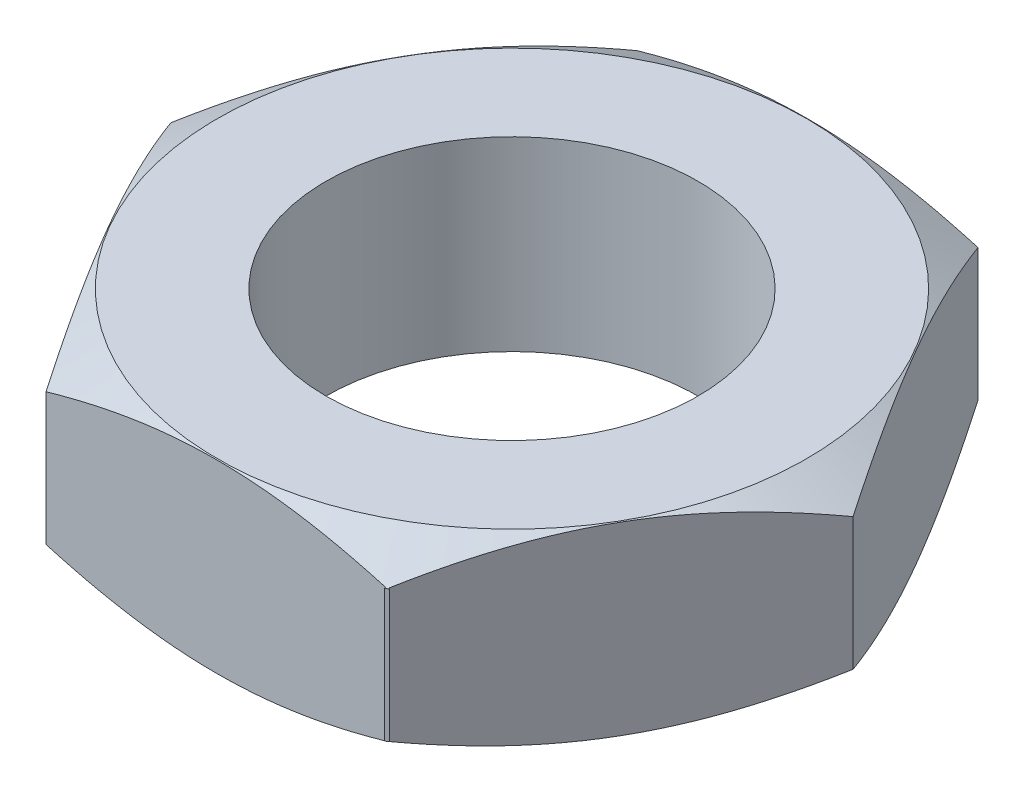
ISO-10303-21;
HEADER;
FILE_DESCRIPTION(('STEP AP214'),'2;1');
FILE_NAME('part.step','',(''),(''),'','','');
FILE_SCHEMA(('AUTOMOTIVE_DESIGN { 1 0 10303 214 1 1 1 1 }'));
ENDSEC;
DATA;
#1=APPLICATION_CONTEXT('core data for automotive mechanical design processes');
#2=APPLICATION_PROTOCOL_DEFINITION('international standard','automotive_design',2000,#1);
#3=PRODUCT_CONTEXT('',#1,'mechanical');
#4=PRODUCT('Part','Part','',(#3));
#5=PRODUCT_RELATED_PRODUCT_CATEGORY('part','',(#4));
#6=PRODUCT_DEFINITION_FORMATION('','',#4);
#7=PRODUCT_DEFINITION_CONTEXT('part definition',#1,'design');
#8=PRODUCT_DEFINITION('design','',#6,#7);
#9=PRODUCT_DEFINITION_SHAPE('','',#8);
#10=(LENGTH_UNIT() NAMED_UNIT(*) SI_UNIT(.MILLI.,.METRE.));
#11=(NAMED_UNIT(*) PLANE_ANGLE_UNIT() SI_UNIT($,.RADIAN.));
#12=(NAMED_UNIT(*) SI_UNIT($,.STERADIAN.) SOLID_ANGLE_UNIT());
#13=UNCERTAINTY_MEASURE_WITH_UNIT(LENGTH_MEASURE(1.E-05),#10,'distance_accuracy_value','');
#14=(GEOMETRIC_REPRESENTATION_CONTEXT(3) GLOBAL_UNCERTAINTY_ASSIGNED_CONTEXT((#13)) GLOBAL_UNIT_ASSIGNED_CONTEXT((#10,
#11,#12)) REPRESENTATION_CONTEXT('',''));
#15=CARTESIAN_POINT('',(0.,0.,0.));
#16=DIRECTION('',(0.,0.,1.));
#17=DIRECTION('',(1.,0.,0.));
#18=AXIS2_PLACEMENT_3D('',#15,#16,#17);
#19=CARTESIAN_POINT('',(0.,-5.13,0.));
#20=DIRECTION('',(0.,1.,0.));
#21=DIRECTION('',(0.,0.,1.));
#22=AXIS2_PLACEMENT_3D('',#19,#20,#21);
#23=CYLINDRICAL_SURFACE('',#22,11.);
#24=DIRECTION('',(0.,1.,0.));
#25=VECTOR('',#24,1.);
#26=CARTESIAN_POINT('',(5.54559169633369,-2.99801270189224,9.49981119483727));
#27=LINE('',#26,#25);
#28=CARTESIAN_POINT('',(5.54559169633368,-5.13,9.49981119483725));
#29=VERTEX_POINT('',#28);
#30=CARTESIAN_POINT('',(5.54559169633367,-0.86602540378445,9.49981119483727));
#31=VERTEX_POINT('',#30);
#32=EDGE_CURVE('E68',#29,#31,#27,.T.);
#33=ORIENTED_EDGE('',*,*,#32,.T.);
#34=CARTESIAN_POINT('',(0.,-0.86602540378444,0.));
#35=DIRECTION('',(0.,1.,0.));
#36=DIRECTION('',(0.,0.,1.));
#37=AXIS2_PLACEMENT_3D('',#34,#35,#36);
#38=CIRCLE('',#37,11.);
#39=CARTESIAN_POINT('',(5.4441936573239,-0.866025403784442,9.5582820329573));
#40=VERTEX_POINT('',#39);
#41=EDGE_CURVE('E52',#40,#31,#38,.T.);
#42=ORIENTED_EDGE('',*,*,#41,.F.);
#43=DIRECTION('',(0.,-1.,0.));
#44=VECTOR('',#43,1.);
#45=CARTESIAN_POINT('',(5.4441936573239,-2.99801270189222,9.5582820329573));
#46=LINE('',#45,#44);
#47=CARTESIAN_POINT('',(5.4441936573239,-5.13,9.5582820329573));
#48=VERTEX_POINT('',#47);
#49=EDGE_CURVE('E84',#40,#48,#46,.T.);
#50=ORIENTED_EDGE('',*,*,#49,.T.);
#51=CARTESIAN_POINT('',(0.,-5.13,0.));
#52=DIRECTION('',(0.,1.,0.));
#53=DIRECTION('',(0.,0.,1.));
#54=AXIS2_PLACEMENT_3D('',#51,#52,#53);
#55=CIRCLE('',#54,11.);
#56=EDGE_CURVE('E64',#29,#48,#55,.F.);
#57=ORIENTED_EDGE('',*,*,#56,.F.);
#58=EDGE_LOOP('',(#33,#42,#50,#57));
#59=FACE_BOUND('',#58,.T.);
#60=ADVANCED_FACE('F16',(#59),#23,.T.);
#61=CARTESIAN_POINT('',(5.5231934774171,-0.85267708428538,9.4861071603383));
#62=DIRECTION('',(-0.52190008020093,0.,0.853006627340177));
#63=DIRECTION('',(0.,-1.,0.));
#64=AXIS2_PLACEMENT_3D('',#61,#62,#63);
#65=PLANE('',#64);
#66=CARTESIAN_POINT('',(5.54559169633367,-0.866025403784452,9.49981119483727));
#67=CARTESIAN_POINT('',(5.5418588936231,-0.86380014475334,9.4975273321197));
#68=CARTESIAN_POINT('',(5.53812597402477,-0.861575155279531,9.495243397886));
#69=CARTESIAN_POINT('',(5.53065990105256,-0.8571257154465,9.49067538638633));
#70=CARTESIAN_POINT('',(5.52692674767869,-0.854901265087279,9.48839130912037));
#71=CARTESIAN_POINT('',(5.52319347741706,-0.852677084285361,9.48610716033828));
#72=B_SPLINE_CURVE_WITH_KNOTS('',3,(#66,#67,#68,#69,#70,#71),.UNSPECIFIED.,.F.,.F.,(4,2,4),(0.,
0.0147280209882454,0.0294560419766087),.UNSPECIFIED.);
#73=CARTESIAN_POINT('',(5.52319347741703,-0.852677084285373,9.48610716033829));
#74=VERTEX_POINT('',#73);
#75=EDGE_CURVE('E20',#31,#74,#72,.T.);
#76=ORIENTED_EDGE('',*,*,#75,.F.);
#77=ORIENTED_EDGE('',*,*,#32,.F.);
#78=CARTESIAN_POINT('',(5.54559169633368,-5.13,9.49981119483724));
#79=CARTESIAN_POINT('',(5.54465766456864,-5.13055616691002,9.49924101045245));
#80=CARTESIAN_POINT('',(5.54372371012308,-5.13111234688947,9.49867071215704));
#81=CARTESIAN_POINT('',(5.54185599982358,-5.13222470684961,9.49752991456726));
#82=CARTESIAN_POINT('',(5.54092224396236,-5.13278088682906,9.4969594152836));
#83=CARTESIAN_POINT('',(5.53905493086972,-5.1338932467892,9.49581821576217));
#84=CARTESIAN_POINT('',(5.53812137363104,-5.13444942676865,9.49524751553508));
#85=CARTESIAN_POINT('',(5.53625445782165,-5.13556178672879,9.49410591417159));
#86=CARTESIAN_POINT('',(5.53532109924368,-5.13611796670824,9.49353501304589));
#87=CARTESIAN_POINT('',(5.53345458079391,-5.13723032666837,9.49239300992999));
#88=CARTESIAN_POINT('',(5.53252142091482,-5.13778650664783,9.49182190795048));
#89=CARTESIAN_POINT('',(5.53065529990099,-5.13889886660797,9.49067950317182));
#90=CARTESIAN_POINT('',(5.52972233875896,-5.13945504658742,9.49010820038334));
#91=CARTESIAN_POINT('',(5.5278566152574,-5.14056740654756,9.48896539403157));
#92=CARTESIAN_POINT('',(5.52692385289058,-5.14112358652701,9.48839389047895));
#93=CARTESIAN_POINT('',(5.52505852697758,-5.14223594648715,9.48725068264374));
#94=CARTESIAN_POINT('',(5.52412596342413,-5.14279212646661,9.48667897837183));
#95=CARTESIAN_POINT('',(5.52319347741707,-5.14334831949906,9.48610716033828));
#96=B_SPLINE_CURVE_WITH_KNOTS('',3,(#78,#79,#80,#81,#82,#83,#84,#85,#86,#87,#88,#89,#90,#91,#92,
#93,#94,#95),.UNSPECIFIED.,.F.,.F.,(4,2,2,2,2,2,2,2,4),(0.,0.00368261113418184,
0.00736504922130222,0.0110473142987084,0.01472940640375,0.0184113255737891,0.0220930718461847,
0.0257746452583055,0.0294560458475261),.UNSPECIFIED.);
#97=CARTESIAN_POINT('',(5.52319347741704,-5.14334831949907,9.48610716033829));
#98=VERTEX_POINT('',#97);
#99=EDGE_CURVE('E235',#29,#98,#96,.T.);
#100=ORIENTED_EDGE('',*,*,#99,.T.);
#101=DIRECTION('',(0.,1.,0.));
#102=VECTOR('',#101,1.);
#103=CARTESIAN_POINT('',(5.523193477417,-5.49207425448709,9.4861071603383));
#104=LINE('',#103,#102);
#105=EDGE_CURVE('E78',#98,#74,#104,.T.);
#106=ORIENTED_EDGE('',*,*,#105,.T.);
#107=EDGE_LOOP('',(#76,#77,#100,#106));
#108=FACE_BOUND('',#107,.T.);
#109=ADVANCED_FACE('F76',(#108),#65,.F.);
#110=CARTESIAN_POINT('',(5.4441936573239,-0.85102928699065,9.5582820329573));
#111=DIRECTION('',(0.993479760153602,0.,0.114008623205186));
#112=DIRECTION('',(0.,-1.,0.));
#113=AXIS2_PLACEMENT_3D('',#110,#111,#112);
#114=PLANE('',#113);
#115=CARTESIAN_POINT('',(5.44786617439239,-5.1449961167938,9.52627944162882));
#116=CARTESIAN_POINT('',(5.44725401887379,-5.14249807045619,9.53161381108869));
#117=CARTESIAN_POINT('',(5.44664189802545,-5.13999937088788,9.53694787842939));
#118=CARTESIAN_POINT('',(5.44541772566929,-5.13500066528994,9.54761540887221));
#119=CARTESIAN_POINT('',(5.44480567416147,-5.13250065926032,9.55294887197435));
#120=CARTESIAN_POINT('',(5.4441936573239,-5.13,9.5582820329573));
#121=B_SPLINE_CURVE_WITH_KNOTS('',3,(#115,#116,#117,#118,#119,#120),.UNSPECIFIED.,.F.,.F.,(4,2,
4),(0.,0.0177660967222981,0.0355321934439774),.UNSPECIFIED.);
#122=CARTESIAN_POINT('',(5.44786617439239,-5.1449961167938,9.52627944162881));
#123=VERTEX_POINT('',#122);
#124=EDGE_CURVE('E88',#123,#48,#121,.T.);
#125=ORIENTED_EDGE('',*,*,#124,.T.);
#126=ORIENTED_EDGE('',*,*,#49,.F.);
#127=CARTESIAN_POINT('',(5.44786617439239,-0.851029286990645,9.52627944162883));
#128=CARTESIAN_POINT('',(5.44725401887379,-0.853527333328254,9.5316138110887));
#129=CARTESIAN_POINT('',(5.44664189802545,-0.856026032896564,9.53694787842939));
#130=CARTESIAN_POINT('',(5.44541772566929,-0.861024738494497,9.54761540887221));
#131=CARTESIAN_POINT('',(5.44480567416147,-0.86352474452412,9.55294887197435));
#132=CARTESIAN_POINT('',(5.4441936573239,-0.866025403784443,9.5582820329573));
#133=B_SPLINE_CURVE_WITH_KNOTS('',3,(#127,#128,#129,#130,#131,#132),.UNSPECIFIED.,.F.,.F.,(4,2,
4),(0.,0.0177660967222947,0.0355321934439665),.UNSPECIFIED.);
#134=CARTESIAN_POINT('',(5.44786617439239,-0.851029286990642,9.52627944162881));
#135=VERTEX_POINT('',#134);
#136=EDGE_CURVE('E59',#135,#40,#133,.T.);
#137=ORIENTED_EDGE('',*,*,#136,.F.);
#138=DIRECTION('',(0.,-1.,0.));
#139=VECTOR('',#138,1.);
#140=CARTESIAN_POINT('',(5.4478661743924,-5.48910552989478,9.5262794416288));
#141=LINE('',#140,#139);
#142=EDGE_CURVE('E142',#135,#123,#141,.T.);
#143=ORIENTED_EDGE('',*,*,#142,.T.);
#144=EDGE_LOOP('',(#125,#126,#137,#143));
#145=FACE_BOUND('',#144,.T.);
#146=ADVANCED_FACE('F102',(#145),#114,.F.);
#147=CARTESIAN_POINT('',(0.,-6.,0.));
#148=DIRECTION('',(0.,1.,0.));
#149=DIRECTION('',(0.,0.,1.));
#150=AXIS2_PLACEMENT_3D('',#147,#148,#149);
#151=CONICAL_SURFACE('',#150,9.4931157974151,1.04719755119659);
#152=CARTESIAN_POINT('',(0.,-6.,0.));
#153=DIRECTION('',(0.,1.,0.));
#154=DIRECTION('',(0.,0.,1.));
#155=AXIS2_PLACEMENT_3D('',#152,#153,#154);
#156=CIRCLE('',#155,9.4931157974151);
#157=CARTESIAN_POINT('',(0.,-6.,9.4931157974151));
#158=VERTEX_POINT('',#157);
#159=EDGE_CURVE('E134',#158,#158,#156,.F.);
#160=ORIENTED_EDGE('',*,*,#159,.F.);
#161=EDGE_LOOP('',(#160));
#162=FACE_BOUND('',#161,.T.);
#163=ORIENTED_EDGE('',*,*,#124,.F.);
#164=CARTESIAN_POINT('',(5.44786617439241,-5.1449961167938,9.5262794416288));
#165=CARTESIAN_POINT('',(5.29634924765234,-5.18842214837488,9.52627944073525));
#166=CARTESIAN_POINT('',(5.14447208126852,-5.23058850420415,9.52627944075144));
#167=CARTESIAN_POINT('',(4.86848364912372,-5.30455113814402,9.52627944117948));
#168=CARTESIAN_POINT('',(4.74449648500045,-5.33681111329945,9.5262794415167));
#169=CARTESIAN_POINT('',(4.39626799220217,-5.4245461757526,9.52627944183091));
#170=CARTESIAN_POINT('',(4.17147613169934,-5.47785987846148,9.52627944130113));
#171=CARTESIAN_POINT('',(3.73902082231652,-5.57340715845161,9.52627944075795));
#172=CARTESIAN_POINT('',(3.53147954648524,-5.6161925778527,9.52627944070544));
#173=CARTESIAN_POINT('',(3.15439842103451,-5.68790361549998,9.52627944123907));
#174=CARTESIAN_POINT('',(2.9850662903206,-5.71792173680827,9.52627944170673));
#175=CARTESIAN_POINT('',(2.64682138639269,-5.77326897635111,9.5262794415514));
#176=CARTESIAN_POINT('',(2.47791365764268,-5.79862874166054,9.52627944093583));
#177=CARTESIAN_POINT('',(2.17095942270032,-5.84037009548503,9.52627944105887));
#178=CARTESIAN_POINT('',(2.0330200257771,-5.85754422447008,9.52627944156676));
#179=CARTESIAN_POINT('',(1.70384862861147,-5.89461956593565,9.52627944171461));
#180=CARTESIAN_POINT('',(1.51244712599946,-5.91304452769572,9.52627944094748));
#181=CARTESIAN_POINT('',(1.16458786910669,-5.94062693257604,9.52627944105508));
#182=CARTESIAN_POINT('',(1.00821491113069,-5.95086818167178,9.52627944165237));
#183=CARTESIAN_POINT('',(0.695639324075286,-5.96693868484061,9.52627944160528));
#184=CARTESIAN_POINT('',(0.539437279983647,-5.97277914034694,9.52627944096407));
#185=CARTESIAN_POINT('',(0.255480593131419,-5.97936902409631,9.52627944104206));
#186=CARTESIAN_POINT('',(0.127742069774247,-5.98085358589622,9.52627944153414));
#187=CARTESIAN_POINT('',(-0.190977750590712,-5.98085202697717,9.52627944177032));
#188=CARTESIAN_POINT('',(-0.381963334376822,-5.97753154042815,9.52627944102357));
#189=CARTESIAN_POINT('',(-0.729204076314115,-5.96550048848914,9.52627944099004));
#190=CARTESIAN_POINT('',(-0.88549931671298,-5.95787224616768,9.52627944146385));
#191=CARTESIAN_POINT('',(-1.32662636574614,-5.930183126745,9.52627944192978));
#192=CARTESIAN_POINT('',(-1.61115831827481,-5.9050572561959,9.5262794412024));
#193=CARTESIAN_POINT('',(-2.10159286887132,-5.84982233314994,9.52627944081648));
#194=CARTESIAN_POINT('',(-2.30786884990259,-5.82291854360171,9.52627944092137));
#195=CARTESIAN_POINT('',(-2.68308960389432,-5.76764802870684,9.526279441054));
#196=CARTESIAN_POINT('',(-2.85219638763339,-5.74037792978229,9.52627944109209));
#197=CARTESIAN_POINT('',(-3.19073715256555,-5.68129557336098,9.52627944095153));
#198=CARTESIAN_POINT('',(-3.36016620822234,-5.64945515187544,9.52627944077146));
#199=CARTESIAN_POINT('',(-3.6683756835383,-5.58763819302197,9.52627944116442));
#200=CARTESIAN_POINT('',(-3.80728973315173,-5.55832385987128,9.52627944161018));
#201=CARTESIAN_POINT('',(-4.10256468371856,-5.49308512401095,9.52627944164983));
#202=CARTESIAN_POINT('',(-4.25884528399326,-5.45679686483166,9.5262794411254));
#203=CARTESIAN_POINT('',(-4.54314212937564,-5.38778123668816,9.52627944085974));
#204=CARTESIAN_POINT('',(-4.67128063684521,-5.35555511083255,9.52627944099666));
#205=CARTESIAN_POINT('',(-4.927803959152,-5.28892135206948,9.52627944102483));
#206=CARTESIAN_POINT('',(-5.05618569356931,-5.25450186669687,9.5262794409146));
#207=CARTESIAN_POINT('',(-5.2897140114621,-5.19005261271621,9.5262794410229));
#208=CARTESIAN_POINT('',(-5.39494446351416,-5.16032653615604,9.52627944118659));
#209=CARTESIAN_POINT('',(-5.5,-5.13000000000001,9.5262794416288));
#210=B_SPLINE_CURVE_WITH_KNOTS('',3,(#164,#165,#166,#167,#168,#169,#170,#171,#172,#173,#174,
#175,#176,#177,#178,#179,#180,#181,#182,#183,#184,#185,#186,#187,#188,#189,#190,#191,#192,#193,
#194,#195,#196,#197,#198,#199,#200,#201,#202,#203,#204,#205,#206,#207,#208,#209),.UNSPECIFIED.,
.F.,.F.,(4,2,2,2,2,2,2,2,2,2,2,2,2,2,2,2,2,2,2,2,2,2,4),(0.,0.472842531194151,0.857176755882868,
1.55015283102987,2.1857757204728,2.70163775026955,3.21397385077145,3.63095514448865,
4.2076989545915,4.677766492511,5.1466334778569,5.52984589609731,6.10275909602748,
6.5721543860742,7.42867038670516,8.05263104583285,8.56644530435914,9.08357385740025,
9.5094689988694,9.99074747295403,10.387117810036,10.7858495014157,11.1138859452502),.UNSPECIFIED.);
#211=CARTESIAN_POINT('',(-5.5,-5.13000000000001,9.5262794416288));
#212=VERTEX_POINT('',#211);
#213=EDGE_CURVE('E143',#123,#212,#210,.T.);
#214=ORIENTED_EDGE('',*,*,#213,.T.);
#215=CARTESIAN_POINT('',(-5.5,-5.13000000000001,9.5262794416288));
#216=CARTESIAN_POINT('',(-5.57343274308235,-5.17239537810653,9.39909019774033));
#217=CARTESIAN_POINT('',(-5.64703431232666,-5.21361678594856,9.27160854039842));
#218=CARTESIAN_POINT('',(-5.78078413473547,-5.28604660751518,9.03994705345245));
#219=CARTESIAN_POINT('',(-5.84087412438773,-5.3176858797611,8.93586813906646));
#220=CARTESIAN_POINT('',(-6.00929736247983,-5.40370132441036,8.64415053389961));
#221=CARTESIAN_POINT('',(-6.11788760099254,-5.45608774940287,8.45606672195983));
#222=CARTESIAN_POINT('',(-6.31516933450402,-5.54514630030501,8.1143647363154));
#223=CARTESIAN_POINT('',(-6.40373725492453,-5.58291607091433,7.96096059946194));
#224=CARTESIAN_POINT('',(-6.58062144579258,-5.65361845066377,7.6545881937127));
#225=CARTESIAN_POINT('',(-6.66893407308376,-5.68658729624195,7.50162623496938));
#226=CARTESIAN_POINT('',(-6.82940910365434,-5.74199563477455,7.22367532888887));
#227=CARTESIAN_POINT('',(-6.90150138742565,-5.76525101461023,7.09880783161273));
#228=CARTESIAN_POINT('',(-7.07093657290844,-5.81588731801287,6.80533748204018));
#229=CARTESIAN_POINT('',(-7.16838243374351,-5.84191010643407,6.63655629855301));
#230=CARTESIAN_POINT('',(-7.34546330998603,-5.88327840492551,6.32984322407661));
#231=CARTESIAN_POINT('',(-7.42503536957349,-5.89970984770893,6.19202037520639));
#232=CARTESIAN_POINT('',(-7.58405307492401,-5.92809486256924,5.91659363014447));
#233=CARTESIAN_POINT('',(-7.66349790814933,-5.94006646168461,5.77899114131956));
#234=CARTESIAN_POINT('',(-7.80790248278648,-5.95771569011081,5.5288750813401));
#235=CARTESIAN_POINT('',(-7.87283964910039,-5.96414586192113,5.41640061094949));
#236=CARTESIAN_POINT('',(-8.03248125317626,-5.9762008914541,5.13989324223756));
#237=CARTESIAN_POINT('',(-8.12721986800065,-5.98011311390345,4.97580114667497));
#238=CARTESIAN_POINT('',(-8.29944639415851,-5.98128482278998,4.67749605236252));
#239=CARTESIAN_POINT('',(-8.37693324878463,-5.97962629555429,4.54328488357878));
#240=CARTESIAN_POINT('',(-8.53190432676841,-5.9719540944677,4.27486710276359));
#241=CARTESIAN_POINT('',(-8.60938851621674,-5.96593761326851,4.14066054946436));
#242=CARTESIAN_POINT('',(-8.75027945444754,-5.95108108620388,3.89663028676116));
#243=CARTESIAN_POINT('',(-8.8137052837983,-5.94294579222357,3.7867735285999));
#244=CARTESIAN_POINT('',(-8.97682399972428,-5.91835953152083,3.50424362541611));
#245=CARTESIAN_POINT('',(-9.07644011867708,-5.89981566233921,3.3317034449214));
#246=CARTESIAN_POINT('',(-9.25761276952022,-5.85989932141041,3.0179032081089));
#247=CARTESIAN_POINT('',(-9.3392304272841,-5.83961639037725,2.8765372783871));
#248=CARTESIAN_POINT('',(-9.50258820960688,-5.79459411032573,2.59359329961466));
#249=CARTESIAN_POINT('',(-9.58432678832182,-5.76983227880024,2.4520179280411));
#250=CARTESIAN_POINT('',(-9.73300349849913,-5.72091559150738,2.1945023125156));
#251=CARTESIAN_POINT('',(-9.79999728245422,-5.69743093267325,2.07846567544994));
#252=CARTESIAN_POINT('',(-10.0578295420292,-5.60173044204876,1.63188710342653));
#253=CARTESIAN_POINT('',(-10.2477878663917,-5.51995568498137,1.3028696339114));
#254=CARTESIAN_POINT('',(-10.6255651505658,-5.33796479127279,0.648540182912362));
#255=CARTESIAN_POINT('',(-10.8133833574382,-5.23774236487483,0.323229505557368));
#256=CARTESIAN_POINT('',(-11.,-5.12999999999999,0.));
#257=B_SPLINE_CURVE_WITH_KNOTS('',3,(#215,#216,#217,#218,#219,#220,#221,#222,#223,#224,#225,
#226,#227,#228,#229,#230,#231,#232,#233,#234,#235,#236,#237,#238,#239,#240,#241,#242,#243,#244,
#245,#246,#247,#248,#249,#250,#251,#252,#253,#254,#255,#256),.UNSPECIFIED.,.F.,.F.,(4,2,2,2,2,2,
2,2,2,2,2,2,2,2,2,2,2,2,2,2,4),(0.,0.458577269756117,0.831392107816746,1.50152207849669,
2.04482390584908,2.58378491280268,3.02189616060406,3.61164998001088,4.09156469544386,
4.56951795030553,4.95958786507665,5.5280172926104,5.99290810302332,6.45809865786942,
6.83940800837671,7.43955521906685,7.93297136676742,8.42893672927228,8.83700273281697,
10.0023084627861,11.1680122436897),.UNSPECIFIED.);
#258=CARTESIAN_POINT('',(-11.,-5.13,0.));
#259=VERTEX_POINT('',#258);
#260=EDGE_CURVE('E119',#212,#259,#257,.T.);
#261=ORIENTED_EDGE('',*,*,#260,.T.);
#262=CARTESIAN_POINT('',(-11.,-5.12999999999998,0.));
#263=CARTESIAN_POINT('',(-10.8994595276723,-5.18804390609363,-0.174141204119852));
#264=CARTESIAN_POINT('',(-10.7985994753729,-5.24389149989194,-0.3488359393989));
#265=CARTESIAN_POINT('',(-10.6153525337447,-5.34059676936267,-0.666228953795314));
#266=CARTESIAN_POINT('',(-10.5330759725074,-5.38229293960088,-0.808736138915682));
#267=CARTESIAN_POINT('',(-10.3437778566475,-5.47396718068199,-1.1366100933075));
#268=CARTESIAN_POINT('',(-10.2366118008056,-5.52276312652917,-1.32222714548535));
#269=CARTESIAN_POINT('',(-10.0419133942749,-5.60526792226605,-1.65945467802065));
#270=CARTESIAN_POINT('',(-9.95449814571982,-5.64008522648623,-1.81086233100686));
#271=CARTESIAN_POINT('',(-9.76704313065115,-5.70966159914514,-2.13554394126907));
#272=CARTESIAN_POINT('',(-9.66693943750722,-5.74373825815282,-2.30892862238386));
#273=CARTESIAN_POINT('',(-9.48504673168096,-5.79969559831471,-2.62397603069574));
#274=CARTESIAN_POINT('',(-9.40334115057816,-5.82266507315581,-2.76549424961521));
#275=CARTESIAN_POINT('',(-9.24009779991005,-5.86403425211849,-3.04824002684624));
#276=CARTESIAN_POINT('',(-9.1585615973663,-5.88245850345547,-3.18946487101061));
#277=CARTESIAN_POINT('',(-9.01037182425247,-5.91172795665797,-3.44613708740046));
#278=CARTESIAN_POINT('',(-8.94375597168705,-5.92334473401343,-3.56151912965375));
#279=CARTESIAN_POINT('',(-8.78239384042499,-5.94766384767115,-3.84100653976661));
#280=CARTESIAN_POINT('',(-8.68758577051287,-5.95877231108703,-4.00521893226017));
#281=CARTESIAN_POINT('',(-8.5152565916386,-5.97305375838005,-4.30370182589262));
#282=CARTESIAN_POINT('',(-8.43775723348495,-5.9773091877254,-4.43793465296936));
#283=CARTESIAN_POINT('',(-8.28280247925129,-5.9814488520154,-4.70632416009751));
#284=CARTESIAN_POINT('',(-8.20534711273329,-5.98133729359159,-4.84048078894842));
#285=CARTESIAN_POINT('',(-8.06452554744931,-5.97717137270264,-5.0843908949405));
#286=CARTESIAN_POINT('',(-8.00115355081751,-5.97383625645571,-5.19415441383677));
#287=CARTESIAN_POINT('',(-7.84064850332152,-5.96171345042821,-5.47215731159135));
#288=CARTESIAN_POINT('',(-7.74355044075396,-5.95096553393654,-5.64033608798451));
#289=CARTESIAN_POINT('',(-7.56698332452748,-5.92534251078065,-5.94615930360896));
#290=CARTESIAN_POINT('',(-7.48747390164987,-5.91155245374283,-6.08387366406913));
#291=CARTESIAN_POINT('',(-7.32837450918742,-5.87957505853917,-6.35944189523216));
#292=CARTESIAN_POINT('',(-7.24878535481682,-5.86137143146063,-6.49729435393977));
#293=CARTESIAN_POINT('',(-7.10403355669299,-5.82438977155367,-6.74801182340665));
#294=CARTESIAN_POINT('',(-7.03882693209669,-5.80629188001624,-6.86095301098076));
#295=CARTESIAN_POINT('',(-6.86562669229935,-5.75452867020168,-7.1609446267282));
#296=CARTESIAN_POINT('',(-6.75780934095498,-5.71847453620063,-7.34768975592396));
#297=CARTESIAN_POINT('',(-6.5616664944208,-5.64636879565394,-7.68741913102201));
#298=CARTESIAN_POINT('',(-6.47323783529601,-5.61142505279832,-7.8405820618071));
#299=CARTESIAN_POINT('',(-6.29617267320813,-5.5368818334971,-8.14726791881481));
#300=CARTESIAN_POINT('',(-6.20753966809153,-5.49724910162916,-8.30078478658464));
#301=CARTESIAN_POINT('',(-6.04629470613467,-5.42121682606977,-8.58006925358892));
#302=CARTESIAN_POINT('',(-5.97360485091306,-5.38547329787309,-8.70597177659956));
#303=CARTESIAN_POINT('',(-5.76682359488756,-5.27986660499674,-9.06412741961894));
#304=CARTESIAN_POINT('',(-5.63313150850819,-5.20685740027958,-9.29568890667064));
#305=CARTESIAN_POINT('',(-5.50000000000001,-5.13000000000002,-9.52627944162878));
#306=B_SPLINE_CURVE_WITH_KNOTS('',3,(#262,#263,#264,#265,#266,#267,#268,#269,#270,#271,#272,
#273,#274,#275,#276,#277,#278,#279,#280,#281,#282,#283,#284,#285,#286,#287,#288,#289,#290,#291,
#292,#293,#294,#295,#296,#297,#298,#299,#300,#301,#302,#303,#304,#305),.UNSPECIFIED.,.F.,.F.,(4,
2,2,2,2,2,2,2,2,2,2,2,2,2,2,2,2,2,2,2,2,4),(0.,0.627862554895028,1.13709315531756,
1.79644301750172,2.3311822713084,2.94033861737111,3.43533636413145,3.92759920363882,
4.32877962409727,4.89848394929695,5.36359851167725,5.82826504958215,6.20860017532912,
6.79194997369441,7.27074059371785,7.75132590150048,8.14628985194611,8.80203646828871,
9.34281202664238,9.88768308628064,10.3367894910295,11.1681572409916),.UNSPECIFIED.);
#307=CARTESIAN_POINT('',(-5.5,-5.13000000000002,-9.52627944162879));
#308=VERTEX_POINT('',#307);
#309=EDGE_CURVE('E219',#259,#308,#306,.T.);
#310=ORIENTED_EDGE('',*,*,#309,.T.);
#311=CARTESIAN_POINT('',(-5.49999999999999,-5.13000000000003,-9.52627944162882));
#312=CARTESIAN_POINT('',(-5.34322240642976,-5.17525654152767,-9.52627944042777));
#313=CARTESIAN_POINT('',(-5.18605638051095,-5.2191765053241,-9.5262794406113));
#314=CARTESIAN_POINT('',(-4.90046299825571,-5.29614847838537,-9.52627944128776));
#315=CARTESIAN_POINT('',(-4.77216862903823,-5.32969488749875,-9.52627944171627));
#316=CARTESIAN_POINT('',(-4.51585226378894,-5.3945367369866,-9.52627944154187));
#317=CARTESIAN_POINT('',(-4.38783346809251,-5.42584478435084,-9.5262794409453));
#318=CARTESIAN_POINT('',(-4.15518024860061,-5.48067403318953,-9.52627944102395));
#319=CARTESIAN_POINT('',(-4.05063130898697,-5.50455949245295,-9.526279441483));
#320=CARTESIAN_POINT('',(-3.73902536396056,-5.57340617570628,-9.52627944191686));
#321=CARTESIAN_POINT('',(-3.53148065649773,-5.61619233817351,-9.5262794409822));
#322=CARTESIAN_POINT('',(-3.15439753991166,-5.68790380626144,-9.52627944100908));
#323=CARTESIAN_POINT('',(-2.98506605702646,-5.71792178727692,-9.52627944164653));
#324=CARTESIAN_POINT('',(-2.64682162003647,-5.77326892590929,-9.52627944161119));
#325=CARTESIAN_POINT('',(-2.47791371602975,-5.79862872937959,-9.52627944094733));
#326=CARTESIAN_POINT('',(-2.17095937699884,-5.84037010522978,-9.52627944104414));
#327=CARTESIAN_POINT('',(-2.03302001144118,-5.85754422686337,-9.52627944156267));
#328=CARTESIAN_POINT('',(-1.70384865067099,-5.89461956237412,-9.52627944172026));
#329=CARTESIAN_POINT('',(-1.51244713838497,-5.91304452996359,-9.52627944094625));
#330=CARTESIAN_POINT('',(-1.16458786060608,-5.94062693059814,-9.52627944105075));
#331=CARTESIAN_POINT('',(-1.00821489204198,-5.95086817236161,-9.52627944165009));
#332=CARTESIAN_POINT('',(-0.695639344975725,-5.96693869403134,-9.52627944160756));
#333=CARTESIAN_POINT('',(-0.539437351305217,-5.97277917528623,-9.52627944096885));
#334=CARTESIAN_POINT('',(-0.255480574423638,-5.97936899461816,-9.52627944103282));
#335=CARTESIAN_POINT('',(-0.127741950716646,-5.98085348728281,-9.52627944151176));
#336=CARTESIAN_POINT('',(0.190977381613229,-5.98085217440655,-9.52627944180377));
#337=CARTESIAN_POINT('',(0.38196196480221,-5.97753220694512,-9.52627944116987));
#338=CARTESIAN_POINT('',(0.729205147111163,-5.96549994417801,-9.52627944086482));
#339=CARTESIAN_POINT('',(0.885503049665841,-5.95787036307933,-9.52627944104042));
#340=CARTESIAN_POINT('',(1.19817656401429,-5.93824744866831,-9.5262794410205));
#341=CARTESIAN_POINT('',(1.35455157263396,-5.92624442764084,-9.52627944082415));
#342=CARTESIAN_POINT('',(1.63892471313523,-5.90052936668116,-9.52627944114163));
#343=CARTESIAN_POINT('',(1.7669864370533,-5.88750901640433,-9.52627944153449));
#344=CARTESIAN_POINT('',(2.10158072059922,-5.84982076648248,-9.52627944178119));
#345=CARTESIAN_POINT('',(2.30786587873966,-5.82291816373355,-9.52627944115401));
#346=CARTESIAN_POINT('',(2.68309203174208,-5.76764834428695,-9.52627944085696));
#347=CARTESIAN_POINT('',(2.85219703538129,-5.74037801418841,-9.52627944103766));
#348=CARTESIAN_POINT('',(3.19073649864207,-5.68129548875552,-9.52627944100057));
#349=CARTESIAN_POINT('',(3.36016604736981,-5.64945513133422,-9.52627944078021));
#350=CARTESIAN_POINT('',(3.66837581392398,-5.58763821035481,-9.52627944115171));
#351=CARTESIAN_POINT('',(3.80728976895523,-5.55832386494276,-9.52627944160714));
#352=CARTESIAN_POINT('',(4.10256464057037,-5.49308511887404,-9.52627944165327));
#353=CARTESIAN_POINT('',(4.25884527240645,-5.45679686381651,-9.52627944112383));
#354=CARTESIAN_POINT('',(4.54314213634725,-5.38778123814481,-9.52627944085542));
#355=CARTESIAN_POINT('',(4.67128063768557,-5.355555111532,-9.52627944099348));
#356=CARTESIAN_POINT('',(4.92780395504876,-5.28892135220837,-9.52627944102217));
#357=CARTESIAN_POINT('',(5.05618569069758,-5.25450186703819,-9.52627944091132));
#358=CARTESIAN_POINT('',(5.28971401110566,-5.19005261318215,-9.52627944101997));
#359=CARTESIAN_POINT('',(5.39494446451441,-5.1603265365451,-9.52627944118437));
#360=CARTESIAN_POINT('',(5.49999999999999,-5.13000000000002,-9.5262794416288));
#361=B_SPLINE_CURVE_WITH_KNOTS('',3,(#311,#312,#313,#314,#315,#316,#317,#318,#319,#320,#321,
#322,#323,#324,#325,#326,#327,#328,#329,#330,#331,#332,#333,#334,#335,#336,#337,#338,#339,#340,
#341,#342,#343,#344,#345,#346,#347,#348,#349,#350,#351,#352,#353,#354,#355,#356,#357,#358,#359,
#360),.UNSPECIFIED.,.F.,.F.,(4,2,2,2,2,2,2,2,2,2,2,2,2,2,2,2,2,2,2,2,2,2,2,2,4),(0.,
0.489533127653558,0.88734173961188,1.28269682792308,1.6044174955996,2.2400404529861,
2.75590248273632,3.26823858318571,3.68521987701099,4.26196368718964,4.73203122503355,
5.20089821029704,5.58411051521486,6.15702382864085,6.62641906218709,7.09686044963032,
7.48299993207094,8.10696065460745,8.6207749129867,9.13790346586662,9.56379860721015,
10.0450770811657,10.4414474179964,10.8401791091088,11.1682155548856),.UNSPECIFIED.);
#362=CARTESIAN_POINT('',(5.49999999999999,-5.13000000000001,-9.5262794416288));
#363=VERTEX_POINT('',#362);
#364=EDGE_CURVE('E212',#308,#363,#361,.T.);
#365=ORIENTED_EDGE('',*,*,#364,.T.);
#366=CARTESIAN_POINT('',(5.5,-5.13000000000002,-9.52627944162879));
#367=CARTESIAN_POINT('',(5.57343274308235,-5.17239537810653,-9.39909019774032));
#368=CARTESIAN_POINT('',(5.64703431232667,-5.21361678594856,-9.27160854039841));
#369=CARTESIAN_POINT('',(5.78078413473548,-5.28604660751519,-9.03994705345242));
#370=CARTESIAN_POINT('',(5.84087412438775,-5.31768587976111,-8.93586813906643));
#371=CARTESIAN_POINT('',(6.00929736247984,-5.40370132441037,-8.64415053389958));
#372=CARTESIAN_POINT('',(6.11788760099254,-5.45608774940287,-8.45606672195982));
#373=CARTESIAN_POINT('',(6.31516933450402,-5.54514630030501,-8.1143647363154));
#374=CARTESIAN_POINT('',(6.40373725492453,-5.58291607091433,-7.96096059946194));
#375=CARTESIAN_POINT('',(6.58062144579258,-5.65361845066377,-7.6545881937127));
#376=CARTESIAN_POINT('',(6.66893407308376,-5.68658729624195,-7.50162623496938));
#377=CARTESIAN_POINT('',(6.82940910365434,-5.74199563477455,-7.22367532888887));
#378=CARTESIAN_POINT('',(6.90150138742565,-5.76525101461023,-7.09880783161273));
#379=CARTESIAN_POINT('',(7.07093657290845,-5.81588731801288,-6.80533748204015));
#380=CARTESIAN_POINT('',(7.16838243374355,-5.84191010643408,-6.63655629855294));
#381=CARTESIAN_POINT('',(7.34546330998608,-5.88327840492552,-6.32984322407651));
#382=CARTESIAN_POINT('',(7.42503536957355,-5.89970984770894,-6.19202037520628));
#383=CARTESIAN_POINT('',(7.58405307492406,-5.92809486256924,-5.91659363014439));
#384=CARTESIAN_POINT('',(7.66349790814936,-5.94006646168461,-5.77899114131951));
#385=CARTESIAN_POINT('',(7.80790248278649,-5.95771569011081,-5.52887508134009));
#386=CARTESIAN_POINT('',(7.8728396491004,-5.96414586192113,-5.41640061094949));
#387=CARTESIAN_POINT('',(8.03248125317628,-5.9762008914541,-5.13989324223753));
#388=CARTESIAN_POINT('',(8.12721986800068,-5.98011311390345,-4.97580114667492));
#389=CARTESIAN_POINT('',(8.29944639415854,-5.98128482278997,-4.67749605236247));
#390=CARTESIAN_POINT('',(8.37693324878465,-5.97962629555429,-4.54328488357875));
#391=CARTESIAN_POINT('',(8.53190432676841,-5.9719540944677,-4.27486710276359));
#392=CARTESIAN_POINT('',(8.60938851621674,-5.96593761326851,-4.14066054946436));
#393=CARTESIAN_POINT('',(8.75027945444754,-5.95108108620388,-3.89663028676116));
#394=CARTESIAN_POINT('',(8.8137052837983,-5.94294579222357,-3.7867735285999));
#395=CARTESIAN_POINT('',(8.97682399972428,-5.91835953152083,-3.50424362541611));
#396=CARTESIAN_POINT('',(9.07644011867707,-5.89981566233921,-3.3317034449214));
#397=CARTESIAN_POINT('',(9.25761276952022,-5.85989932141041,-3.0179032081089));
#398=CARTESIAN_POINT('',(9.3392304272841,-5.83961639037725,-2.8765372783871));
#399=CARTESIAN_POINT('',(9.5025882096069,-5.79459411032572,-2.59359329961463));
#400=CARTESIAN_POINT('',(9.58432678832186,-5.76983227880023,-2.45201792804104));
#401=CARTESIAN_POINT('',(9.73300349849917,-5.72091559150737,-2.19450231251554));
#402=CARTESIAN_POINT('',(9.79999728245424,-5.69743093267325,-2.07846567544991));
#403=CARTESIAN_POINT('',(10.0578295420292,-5.60173044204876,-1.63188710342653));
#404=CARTESIAN_POINT('',(10.2477878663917,-5.51995568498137,-1.3028696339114));
#405=CARTESIAN_POINT('',(10.6255651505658,-5.33796479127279,-0.648540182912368));
#406=CARTESIAN_POINT('',(10.8133833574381,-5.23774236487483,-0.323229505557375));
#407=CARTESIAN_POINT('',(11.,-5.12999999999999,0.));
#408=B_SPLINE_CURVE_WITH_KNOTS('',3,(#366,#367,#368,#369,#370,#371,#372,#373,#374,#375,#376,
#377,#378,#379,#380,#381,#382,#383,#384,#385,#386,#387,#388,#389,#390,#391,#392,#393,#394,#395,
#396,#397,#398,#399,#400,#401,#402,#403,#404,#405,#406,#407),.UNSPECIFIED.,.F.,.F.,(4,2,2,2,2,2,
2,2,2,2,2,2,2,2,2,2,2,2,2,2,4),(0.,0.458577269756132,0.831392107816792,1.50152207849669,
2.04482390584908,2.58378491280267,3.02189616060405,3.61164998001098,4.09156469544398,
4.56951795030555,4.95958786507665,5.52801729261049,5.99290810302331,6.45809865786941,
6.8394080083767,7.43955521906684,7.93297136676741,8.42893672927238,8.83700273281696,
10.0023084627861,11.1680122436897),.UNSPECIFIED.);
#409=CARTESIAN_POINT('',(11.,-5.13,0.));
#410=VERTEX_POINT('',#409);
#411=EDGE_CURVE('E203',#363,#410,#408,.T.);
#412=ORIENTED_EDGE('',*,*,#411,.T.);
#413=CARTESIAN_POINT('',(11.,-5.12999999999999,0.));
#414=CARTESIAN_POINT('',(10.8994595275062,-5.18804390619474,0.174141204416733));
#415=CARTESIAN_POINT('',(10.7985994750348,-5.24389150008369,0.348835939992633));
#416=CARTESIAN_POINT('',(10.6153525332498,-5.34059676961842,0.66622895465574));
#417=CARTESIAN_POINT('',(10.5330759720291,-5.38229293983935,0.808736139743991));
#418=CARTESIAN_POINT('',(10.3437778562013,-5.47396718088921,1.1366100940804));
#419=CARTESIAN_POINT('',(10.236611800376,-5.52276312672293,1.32222714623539));
#420=CARTESIAN_POINT('',(10.0419133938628,-5.60526792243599,1.65945467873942));
#421=CARTESIAN_POINT('',(9.95449814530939,-5.64008522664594,1.8108623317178));
#422=CARTESIAN_POINT('',(9.7670431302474,-5.7096615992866,2.1355439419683));
#423=CARTESIAN_POINT('',(9.66693943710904,-5.74373825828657,2.3089286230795));
#424=CARTESIAN_POINT('',(9.4850467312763,-5.79969559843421,2.62397603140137));
#425=CARTESIAN_POINT('',(9.40334115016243,-5.82266507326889,2.765494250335));
#426=CARTESIAN_POINT('',(9.24009779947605,-5.8640342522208,3.0482400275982));
#427=CARTESIAN_POINT('',(9.15856159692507,-5.88245850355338,3.18946487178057));
#428=CARTESIAN_POINT('',(9.01037182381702,-5.91172795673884,3.4461370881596));
#429=CARTESIAN_POINT('',(8.94375597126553,-5.92334473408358,3.56151913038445));
#430=CARTESIAN_POINT('',(8.78239384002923,-5.94766384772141,3.84100654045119));
#431=CARTESIAN_POINT('',(8.68758577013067,-5.95877231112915,4.00521893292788));
#432=CARTESIAN_POINT('',(8.51525659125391,-5.97305375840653,4.30370182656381));
#433=CARTESIAN_POINT('',(8.43775723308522,-5.97730918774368,4.43793465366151));
#434=CARTESIAN_POINT('',(8.28280247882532,-5.9814488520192,4.70632416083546));
#435=CARTESIAN_POINT('',(8.2053471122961,-5.98133729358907,4.84048078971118));
#436=CARTESIAN_POINT('',(8.06452554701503,-5.97717137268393,5.08439089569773));
#437=CARTESIAN_POINT('',(8.00115355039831,-5.97383625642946,5.19415441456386));
#438=CARTESIAN_POINT('',(7.84064850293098,-5.96171345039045,5.47215731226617));
#439=CARTESIAN_POINT('',(7.74355044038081,-5.95096553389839,5.64033608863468));
#440=CARTESIAN_POINT('',(7.56698332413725,-5.92534251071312,5.94615930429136));
#441=CARTESIAN_POINT('',(7.48747390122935,-5.91155245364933,6.08387366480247));
#442=CARTESIAN_POINT('',(7.32837450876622,-5.87957505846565,6.35944189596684));
#443=CARTESIAN_POINT('',(7.24878535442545,-5.86137143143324,6.49729435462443));
#444=CARTESIAN_POINT('',(7.10403355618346,-5.82438977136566,6.74801182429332));
#445=CARTESIAN_POINT('',(7.03882693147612,-5.80629187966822,6.86095301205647));
#446=CARTESIAN_POINT('',(6.86562669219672,-5.75452867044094,7.16094462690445));
#447=CARTESIAN_POINT('',(6.75780934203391,-5.71847453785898,7.34768975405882));
#448=CARTESIAN_POINT('',(6.56166649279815,-5.64636879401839,7.68741913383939));
#449=CARTESIAN_POINT('',(6.47323783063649,-5.61142504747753,7.84058206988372));
#450=CARTESIAN_POINT('',(6.29617267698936,-5.53688183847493,8.14726791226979));
#451=CARTESIAN_POINT('',(6.2075396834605,-5.49724912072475,8.30078475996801));
#452=CARTESIAN_POINT('',(6.0462946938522,-5.42121681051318,8.58006927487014));
#453=CARTESIAN_POINT('',(5.97360480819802,-5.38547324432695,8.70597185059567));
#454=CARTESIAN_POINT('',(5.77461774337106,-5.28384726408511,9.05062755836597));
#455=CARTESIAN_POINT('',(5.64865646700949,-5.21531982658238,9.26879888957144));
#456=CARTESIAN_POINT('',(5.52319347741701,-5.14334831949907,9.48610716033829));
#457=B_SPLINE_CURVE_WITH_KNOTS('',3,(#413,#414,#415,#416,#417,#418,#419,#420,#421,#422,#423,
#424,#425,#426,#427,#428,#429,#430,#431,#432,#433,#434,#435,#436,#437,#438,#439,#440,#441,#442,
#443,#444,#445,#446,#447,#448,#449,#450,#451,#452,#453,#454,#455,#456),.UNSPECIFIED.,.F.,.F.,(4,
2,2,2,2,2,2,2,2,2,2,2,2,2,2,2,2,2,2,2,2,4),(0.,0.627862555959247,1.13709315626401,
1.79644301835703,2.33118227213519,2.94033861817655,3.43533636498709,3.92759920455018,
4.3287796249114,4.89848395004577,5.363598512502,5.82826505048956,6.20860017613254,
6.79194997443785,7.2707405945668,7.75132590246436,8.14628985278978,8.80203646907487,
9.34281202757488,9.88768308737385,10.336789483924,11.1198931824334),.UNSPECIFIED.);
#458=EDGE_CURVE('E153',#410,#98,#457,.T.);
#459=ORIENTED_EDGE('',*,*,#458,.T.);
#460=ORIENTED_EDGE('',*,*,#99,.F.);
#461=ORIENTED_EDGE('',*,*,#56,.T.);
#462=EDGE_LOOP('',(#163,#214,#261,#310,#365,#412,#459,#460,#461));
#463=FACE_BOUND('',#462,.T.);
#464=ADVANCED_FACE('F106',(#162,#463),#151,.T.);
#465=CARTESIAN_POINT('',(-5.5,-0.016645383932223,9.5262794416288));
#466=DIRECTION('',(0.866025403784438,0.,-0.500000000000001));
#467=DIRECTION('',(0.,-1.,0.));
#468=AXIS2_PLACEMENT_3D('',#465,#466,#467);
#469=PLANE('',#468);
#470=DIRECTION('',(0.,1.,0.));
#471=VECTOR('',#470,1.);
#472=CARTESIAN_POINT('',(-5.5,-5.48910552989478,9.5262794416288));
#473=LINE('',#472,#471);
#474=CARTESIAN_POINT('',(-5.49999999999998,-0.866025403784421,9.5262794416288));
#475=VERTEX_POINT('',#474);
#476=EDGE_CURVE('E151',#212,#475,#473,.T.);
#477=ORIENTED_EDGE('',*,*,#476,.T.);
#478=CARTESIAN_POINT('',(-5.49999999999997,-0.866025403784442,9.52627944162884));
#479=CARTESIAN_POINT('',(-5.63313149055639,-0.789168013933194,9.29568893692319));
#480=CARTESIAN_POINT('',(-5.76682355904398,-0.716158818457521,9.06412748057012));
#481=CARTESIAN_POINT('',(-5.97360479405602,-0.61055213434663,8.7059718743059));
#482=CARTESIAN_POINT('',(-6.0462946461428,-0.574808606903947,8.58006935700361));
#483=CARTESIAN_POINT('',(-6.20753960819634,-0.498776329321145,8.30078489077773));
#484=CARTESIAN_POINT('',(-6.29617261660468,-0.45914359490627,8.14726801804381));
#485=CARTESIAN_POINT('',(-6.47323778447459,-0.384600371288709,7.84058215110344));
#486=CARTESIAN_POINT('',(-6.56166644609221,-0.349656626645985,7.68741921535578));
#487=CARTESIAN_POINT('',(-6.75780929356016,-0.27755088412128,7.34768983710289));
#488=CARTESIAN_POINT('',(-6.86562664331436,-0.241496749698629,7.16094470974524));
#489=CARTESIAN_POINT('',(-7.03882688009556,-0.189733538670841,6.86095310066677));
#490=CARTESIAN_POINT('',(-7.10403350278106,-0.171635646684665,6.7480119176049));
#491=CARTESIAN_POINT('',(-7.2487853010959,-0.134653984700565,6.49729444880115));
#492=CARTESIAN_POINT('',(-7.32837445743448,-0.116450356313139,6.35944198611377));
#493=CARTESIAN_POINT('',(-7.48747385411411,-0.0844729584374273,6.08387374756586));
#494=CARTESIAN_POINT('',(-7.5669832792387,-0.07068290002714,5.9461593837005));
#495=CARTESIAN_POINT('',(-7.74355039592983,-0.0450598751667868,5.64033616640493));
#496=CARTESIAN_POINT('',(-7.84064845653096,-0.0343119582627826,5.47215739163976));
#497=CARTESIAN_POINT('',(-8.00115350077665,-0.0221891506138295,5.19415449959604));
#498=CARTESIAN_POINT('',(-8.06452549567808,-0.0188540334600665,5.08439098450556));
#499=CARTESIAN_POINT('',(-8.20534706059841,-0.0146881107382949,4.84048087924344));
#500=CARTESIAN_POINT('',(-8.2828024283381,-0.0145765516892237,4.70632424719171));
#501=CARTESIAN_POINT('',(-8.43775718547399,-0.0187162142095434,4.43793473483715));
#502=CARTESIAN_POINT('',(-8.51525654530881,-0.0229716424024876,4.30370190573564));
#503=CARTESIAN_POINT('',(-8.68758572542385,-0.0372530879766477,4.00521901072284));
#504=CARTESIAN_POINT('',(-8.7823937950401,-0.048361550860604,3.84100661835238));
#505=CARTESIAN_POINT('',(-8.94375592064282,-0.0726806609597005,3.56151921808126));
#506=CARTESIAN_POINT('',(-9.01037176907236,-0.0842974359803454,3.44613718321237));
#507=CARTESIAN_POINT('',(-9.15856154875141,-0.113566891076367,3.18946495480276));
#508=CARTESIAN_POINT('',(-9.24009776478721,-0.131991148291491,3.04824008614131));
#509=CARTESIAN_POINT('',(-9.40334108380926,-0.173360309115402,2.76549436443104));
#510=CARTESIAN_POINT('',(-9.48504661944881,-0.196329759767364,2.62397622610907));
#511=CARTESIAN_POINT('',(-9.66693947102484,-0.252287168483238,2.30892856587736));
#512=CARTESIAN_POINT('',(-9.76704341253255,-0.286363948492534,2.13554345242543));
#513=CARTESIAN_POINT('',(-9.94314582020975,-0.351726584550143,1.83052513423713));
#514=CARTESIAN_POINT('',(-10.0192604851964,-0.381774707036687,1.69869066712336));
#515=CARTESIAN_POINT('',(-10.1887355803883,-0.452465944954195,1.40515119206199));
#516=CARTESIAN_POINT('',(-10.2820084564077,-0.49395130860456,1.24359783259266));
#517=CARTESIAN_POINT('',(-10.4688588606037,-0.581855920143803,0.919963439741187));
#518=CARTESIAN_POINT('',(-10.5624315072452,-0.628316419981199,0.757890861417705));
#519=CARTESIAN_POINT('',(-10.7709039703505,-0.736843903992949,0.39680596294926));
#520=CARTESIAN_POINT('',(-10.8856605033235,-0.800016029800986,0.19804181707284));
#521=CARTESIAN_POINT('',(-11.,-0.866025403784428,0.));
#522=B_SPLINE_CURVE_WITH_KNOTS('',3,(#478,#479,#480,#481,#482,#483,#484,#485,#486,#487,#488,
#489,#490,#491,#492,#493,#494,#495,#496,#497,#498,#499,#500,#501,#502,#503,#504,#505,#506,#507,
#508,#509,#510,#511,#512,#513,#514,#515,#516,#517,#518,#519,#520,#521),.UNSPECIFIED.,.F.,.F.,(4,
2,2,2,2,2,2,2,2,2,2,2,2,2,2,2,2,2,2,2,2,4),(0.,0.831367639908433,1.28047402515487,
1.82534510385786,2.36612067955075,3.02186728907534,3.41683122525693,3.8974165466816,
4.37620717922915,4.95955697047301,5.3398920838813,5.80455863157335,6.26967320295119,
6.83937752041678,7.24055792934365,7.73282077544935,8.22781852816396,8.83697487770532,
9.30244131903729,9.87568374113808,10.4541137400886,11.1681579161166),.UNSPECIFIED.);
#523=CARTESIAN_POINT('',(-11.,-0.866025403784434,0.));
#524=VERTEX_POINT('',#523);
#525=EDGE_CURVE('E125',#475,#524,#522,.T.);
#526=ORIENTED_EDGE('',*,*,#525,.T.);
#527=DIRECTION('',(0.,-1.,0.));
#528=VECTOR('',#527,1.);
#529=CARTESIAN_POINT('',(-11.,-5.51526773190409,0.));
#530=LINE('',#529,#528);
#531=EDGE_CURVE('E218',#524,#259,#530,.T.);
#532=ORIENTED_EDGE('',*,*,#531,.T.);
#533=ORIENTED_EDGE('',*,*,#260,.F.);
#534=EDGE_LOOP('',(#477,#526,#532,#533));
#535=FACE_BOUND('',#534,.T.);
#536=ADVANCED_FACE('F109',(#535),#469,.F.);
#537=CARTESIAN_POINT('',(-11.,-0.015267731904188,0.));
#538=DIRECTION('',(0.866025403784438,0.,0.500000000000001));
#539=DIRECTION('',(0.,-1.,0.));
#540=AXIS2_PLACEMENT_3D('',#537,#538,#539);
#541=PLANE('',#540);
#542=ORIENTED_EDGE('',*,*,#531,.F.);
#543=CARTESIAN_POINT('',(-11.,-0.866025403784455,0.));
#544=CARTESIAN_POINT('',(-10.9233610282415,-0.821779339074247,-0.132742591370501));
#545=CARTESIAN_POINT('',(-10.8465343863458,-0.778809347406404,-0.265810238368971));
#546=CARTESIAN_POINT('',(-10.6761424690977,-0.686811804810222,-0.560937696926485));
#547=CARTESIAN_POINT('',(-10.5824890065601,-0.638437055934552,-0.723150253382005));
#548=CARTESIAN_POINT('',(-10.3954238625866,-0.546561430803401,-1.04715658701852));
#549=CARTESIAN_POINT('',(-10.3020168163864,-0.503022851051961,-1.20894233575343));
#550=CARTESIAN_POINT('',(-10.0948983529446,-0.412080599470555,-1.56768203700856));
#551=CARTESIAN_POINT('',(-9.98106218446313,-0.365800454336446,-1.76485206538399));
#552=CARTESIAN_POINT('',(-9.79999712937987,-0.298594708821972,-2.07846594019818));
#553=CARTESIAN_POINT('',(-9.73300348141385,-0.275109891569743,-2.19450234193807));
#554=CARTESIAN_POINT('',(-9.58432689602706,-0.226193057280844,-2.45201774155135));
#555=CARTESIAN_POINT('',(-9.50258827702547,-0.20143128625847,-2.59359318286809));
#556=CARTESIAN_POINT('',(-9.33923046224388,-0.156409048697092,-2.87653721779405));
#557=CARTESIAN_POINT('',(-9.25761281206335,-0.136126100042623,-3.01790313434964));
#558=CARTESIAN_POINT('',(-9.07644016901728,-0.0962097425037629,-3.3317033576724));
#559=CARTESIAN_POINT('',(-8.976824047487,-0.0776658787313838,-3.50424354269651));
#560=CARTESIAN_POINT('',(-8.81370533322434,-0.0530796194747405,-3.78677344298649));
#561=CARTESIAN_POINT('',(-8.75027950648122,-0.044944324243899,-3.89663019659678));
#562=CARTESIAN_POINT('',(-8.60938856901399,-0.0300877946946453,-4.14066045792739));
#563=CARTESIAN_POINT('',(-8.53190437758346,-0.0240713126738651,-4.27486701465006));
#564=CARTESIAN_POINT('',(-8.37693329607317,-0.0163991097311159,-4.54328480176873));
#565=CARTESIAN_POINT('',(-8.29944643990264,-0.0147405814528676,-4.67749597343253));
#566=CARTESIAN_POINT('',(-8.12721991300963,-0.0159122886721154,-4.97580106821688));
#567=CARTESIAN_POINT('',(-8.03248129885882,-0.0198245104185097,-5.13989316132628));
#568=CARTESIAN_POINT('',(-7.87283969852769,-0.0318795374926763,-5.41640052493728));
#569=CARTESIAN_POINT('',(-7.80790253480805,-0.0383097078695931,-5.52887499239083));
#570=CARTESIAN_POINT('',(-7.66349796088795,-0.0559589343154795,-5.77899105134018));
#571=CARTESIAN_POINT('',(-7.58405312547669,-0.0679305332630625,-5.91659354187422));
#572=CARTESIAN_POINT('',(-7.42503541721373,-0.0963155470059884,-6.19202029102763));
#573=CARTESIAN_POINT('',(-7.34546335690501,-0.112746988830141,-6.3298431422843));
#574=CARTESIAN_POINT('',(-7.1683824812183,-0.154115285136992,-6.63655621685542));
#575=CARTESIAN_POINT('',(-7.07093662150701,-0.180138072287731,-6.80533739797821));
#576=CARTESIAN_POINT('',(-6.90150143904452,-0.230774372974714,-7.09880774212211));
#577=CARTESIAN_POINT('',(-6.82940915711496,-0.254029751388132,-7.22367523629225));
#578=CARTESIAN_POINT('',(-6.6689341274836,-0.309438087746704,-7.50162614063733));
#579=CARTESIAN_POINT('',(-6.58062149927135,-0.342406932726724,-7.65458810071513));
#580=CARTESIAN_POINT('',(-6.40373730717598,-0.41310931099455,-7.96096050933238));
#581=CARTESIAN_POINT('',(-6.31516938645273,-0.45087908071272,-8.11436464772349));
#582=CARTESIAN_POINT('',(-6.11788765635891,-0.539937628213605,-8.45606662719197));
#583=CARTESIAN_POINT('',(-6.00929742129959,-0.592324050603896,-8.64415043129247));
#584=CARTESIAN_POINT('',(-5.84087419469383,-0.678339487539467,-8.93586801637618));
#585=CARTESIAN_POINT('',(-5.78078421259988,-0.70997875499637,-9.0399469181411));
#586=CARTESIAN_POINT('',(-5.64703436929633,-0.782408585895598,-9.27160844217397));
#587=CARTESIAN_POINT('',(-5.57343277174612,-0.823630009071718,-9.39909014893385));
#588=CARTESIAN_POINT('',(-5.50000000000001,-0.866025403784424,-9.52627944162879));
#589=B_SPLINE_CURVE_WITH_KNOTS('',3,(#543,#544,#545,#546,#547,#548,#549,#550,#551,#552,#553,
#554,#555,#556,#557,#558,#559,#560,#561,#562,#563,#564,#565,#566,#567,#568,#569,#570,#571,#572,
#573,#574,#575,#576,#577,#578,#579,#580,#581,#582,#583,#584,#585,#586,#587,#588),.UNSPECIFIED.,
.F.,.F.,(4,2,2,2,2,2,2,2,2,2,2,2,2,2,2,2,2,2,2,2,2,2,4),(0.,0.478615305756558,1.05892341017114,
1.63433172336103,2.33117815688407,2.73924396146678,3.23520933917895,3.72862550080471,
4.32877270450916,4.71008204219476,5.17527260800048,5.64016342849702,6.20859284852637,
6.59866275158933,7.07661601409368,7.55653073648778,8.14628454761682,8.58439578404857,
9.12335679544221,9.66665862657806,10.3367885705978,10.7096033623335,11.1681808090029),.UNSPECIFIED.);
#590=CARTESIAN_POINT('',(-5.5,-0.866025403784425,-9.52627944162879));
#591=VERTEX_POINT('',#590);
#592=EDGE_CURVE('E133',#524,#591,#589,.T.);
#593=ORIENTED_EDGE('',*,*,#592,.T.);
#594=DIRECTION('',(0.,-1.,0.));
#595=VECTOR('',#594,1.);
#596=CARTESIAN_POINT('',(-5.5,-5.51517244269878,-9.5262794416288));
#597=LINE('',#596,#595);
#598=EDGE_CURVE('E211',#591,#308,#597,.T.);
#599=ORIENTED_EDGE('',*,*,#598,.T.);
#600=ORIENTED_EDGE('',*,*,#309,.F.);
#601=EDGE_LOOP('',(#542,#593,#599,#600));
#602=FACE_BOUND('',#601,.T.);
#603=ADVANCED_FACE('F114',(#602),#541,.F.);
#604=CARTESIAN_POINT('',(-5.5,-0.015172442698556,-9.5262794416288));
#605=DIRECTION('',(0.,0.,1.));
#606=DIRECTION('',(0.,-1.,0.));
#607=AXIS2_PLACEMENT_3D('',#604,#605,#606);
#608=PLANE('',#607);
#609=ORIENTED_EDGE('',*,*,#598,.F.);
#610=CARTESIAN_POINT('',(-5.50000000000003,-0.866025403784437,-9.5262794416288));
#611=CARTESIAN_POINT('',(-5.39494453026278,-0.835698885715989,-9.52627944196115));
#612=CARTESIAN_POINT('',(-5.28971414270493,-0.805972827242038,-9.5262794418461));
#613=CARTESIAN_POINT('',(-5.0561858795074,-0.741523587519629,-9.52627944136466));
#614=CARTESIAN_POINT('',(-4.92780413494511,-0.707104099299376,-9.52627944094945));
#615=CARTESIAN_POINT('',(-4.67128080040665,-0.640470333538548,-9.52627944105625));
#616=CARTESIAN_POINT('',(-4.54314229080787,-0.608244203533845,-9.52627944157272));
#617=CARTESIAN_POINT('',(-4.25884541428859,-0.539228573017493,-9.52627944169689));
#618=CARTESIAN_POINT('',(-4.10256477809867,-0.502940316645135,-9.52627944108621));
#619=CARTESIAN_POINT('',(-3.80728989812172,-0.43770156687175,-9.52627944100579));
#620=CARTESIAN_POINT('',(-3.66837593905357,-0.408387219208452,-9.52627944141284));
#621=CARTESIAN_POINT('',(-3.36016616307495,-0.346570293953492,-9.52627944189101));
#622=CARTESIAN_POINT('',(-3.19073660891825,-0.314729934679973,-9.52627944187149));
#623=CARTESIAN_POINT('',(-2.8521971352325,-0.255647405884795,-9.52627944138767));
#624=CARTESIAN_POINT('',(-2.68309212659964,-0.228377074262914,-9.52627944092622));
#625=CARTESIAN_POINT('',(-2.30786597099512,-0.173107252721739,-9.52627944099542));
#626=CARTESIAN_POINT('',(-2.1015808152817,-0.146204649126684,-9.52627944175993));
#627=CARTESIAN_POINT('',(-1.76698653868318,-0.108516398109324,-9.52627944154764));
#628=CARTESIAN_POINT('',(-1.63892481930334,-0.0954960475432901,-9.52627944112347));
#629=CARTESIAN_POINT('',(-1.3545516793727,-0.0697809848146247,-9.52627944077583));
#630=CARTESIAN_POINT('',(-1.19817666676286,-0.0577779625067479,-9.52627944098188));
#631=CARTESIAN_POINT('',(-0.885503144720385,-0.0381550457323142,-9.52627944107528));
#632=CARTESIAN_POINT('',(-0.729205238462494,-0.0305254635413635,-9.52627944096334));
#633=CARTESIAN_POINT('',(-0.381962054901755,-0.0184931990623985,-9.52627944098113));
#634=CARTESIAN_POINT('',(-0.190977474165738,-0.0151732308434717,-9.52627944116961));
#635=CARTESIAN_POINT('',(0.127741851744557,-0.0151719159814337,-9.52627944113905));
#636=CARTESIAN_POINT('',(0.255480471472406,-0.0166564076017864,-9.52627944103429));
#637=CARTESIAN_POINT('',(0.539437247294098,-0.0232462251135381,-9.52627944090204));
#638=CARTESIAN_POINT('',(0.695639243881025,-0.0290867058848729,-9.52627944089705));
#639=CARTESIAN_POINT('',(1.0082147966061,-0.0451572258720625,-9.52627944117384));
#640=CARTESIAN_POINT('',(1.16458776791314,-0.0553984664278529,-9.52627944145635));
#641=CARTESIAN_POINT('',(1.51244704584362,-0.0829808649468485,-9.52627944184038));
#642=CARTESIAN_POINT('',(1.70384855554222,-0.101405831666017,-9.52627944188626));
#643=CARTESIAN_POINT('',(2.03301991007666,-0.138481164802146,-9.52627944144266));
#644=CARTESIAN_POINT('',(2.17095927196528,-0.15565528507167,-9.52627944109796));
#645=CARTESIAN_POINT('',(2.47791360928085,-0.197396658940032,-9.52627944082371));
#646=CARTESIAN_POINT('',(2.64682151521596,-0.222756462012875,-9.52627944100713));
#647=CARTESIAN_POINT('',(2.9850659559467,-0.278103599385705,-9.52627944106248));
#648=CARTESIAN_POINT('',(3.15439744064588,-0.308121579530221,-9.52627944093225));
#649=CARTESIAN_POINT('',(3.53148055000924,-0.379833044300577,-9.52627944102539));
#650=CARTESIAN_POINT('',(3.73902524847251,-0.422619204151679,-9.52627944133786));
#651=CARTESIAN_POINT('',(4.05063116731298,-0.491465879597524,-9.5262794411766));
#652=CARTESIAN_POINT('',(4.15518008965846,-0.515351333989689,-9.52627944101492));
#653=CARTESIAN_POINT('',(4.38783329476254,-0.570180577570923,-9.52627944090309));
#654=CARTESIAN_POINT('',(4.51585209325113,-0.601488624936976,-9.52627944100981));
#655=CARTESIAN_POINT('',(4.77216846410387,-0.666330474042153,-9.52627944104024));
#656=CARTESIAN_POINT('',(4.90046283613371,-0.69987688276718,-9.52627944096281));
#657=CARTESIAN_POINT('',(5.18605627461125,-0.776848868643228,-9.52627944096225));
#658=CARTESIAN_POINT('',(5.34322235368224,-0.820768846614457,-9.52627944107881));
#659=CARTESIAN_POINT('',(5.49999999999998,-0.866025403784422,-9.5262794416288));
#660=B_SPLINE_CURVE_WITH_KNOTS('',3,(#610,#611,#612,#613,#614,#615,#616,#617,#618,#619,#620,
#621,#622,#623,#624,#625,#626,#627,#628,#629,#630,#631,#632,#633,#634,#635,#636,#637,#638,#639,
#640,#641,#642,#643,#644,#645,#646,#647,#648,#649,#650,#651,#652,#653,#654,#655,#656,#657,#658,
#659),.UNSPECIFIED.,.F.,.F.,(4,2,2,2,2,2,2,2,2,2,2,2,2,2,2,2,2,2,2,2,2,2,2,2,4),(0.,
0.328036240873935,0.726767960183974,1.12313832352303,1.60441681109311,2.03031196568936,
2.54744053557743,3.06125480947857,3.6852155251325,4.07135499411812,4.54179639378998,
5.01119163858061,5.58410494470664,5.96731723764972,6.4361842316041,6.90625177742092,
7.48299557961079,7.89997686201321,8.41231296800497,8.92817500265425,9.56379793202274,
9.88551854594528,10.2808736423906,10.6786822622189,11.1682155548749),.UNSPECIFIED.);
#661=CARTESIAN_POINT('',(5.49999999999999,-0.866025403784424,-9.5262794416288));
#662=VERTEX_POINT('',#661);
#663=EDGE_CURVE('E192',#591,#662,#660,.T.);
#664=ORIENTED_EDGE('',*,*,#663,.T.);
#665=DIRECTION('',(0.,-1.,0.));
#666=VECTOR('',#665,1.);
#667=CARTESIAN_POINT('',(5.5,-5.51664538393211,-9.5262794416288));
#668=LINE('',#667,#666);
#669=EDGE_CURVE('E210',#662,#363,#668,.T.);
#670=ORIENTED_EDGE('',*,*,#669,.T.);
#671=ORIENTED_EDGE('',*,*,#364,.F.);
#672=EDGE_LOOP('',(#609,#664,#670,#671));
#673=FACE_BOUND('',#672,.T.);
#674=ADVANCED_FACE('F199',(#673),#608,.F.);
#675=CARTESIAN_POINT('',(5.5,-0.016645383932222,-9.5262794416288));
#676=DIRECTION('',(-0.866025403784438,0.,0.500000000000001));
#677=DIRECTION('',(0.,-1.,0.));
#678=AXIS2_PLACEMENT_3D('',#675,#676,#677);
#679=PLANE('',#678);
#680=ORIENTED_EDGE('',*,*,#669,.F.);
#681=CARTESIAN_POINT('',(5.49999999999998,-0.866025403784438,-9.52627944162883));
#682=CARTESIAN_POINT('',(5.63313149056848,-0.7891680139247,-9.29568893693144));
#683=CARTESIAN_POINT('',(5.76682355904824,-0.716158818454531,-9.06412748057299));
#684=CARTESIAN_POINT('',(5.97360479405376,-0.610552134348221,-8.70597187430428));
#685=CARTESIAN_POINT('',(6.0462946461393,-0.574808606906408,-8.58006935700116));
#686=CARTESIAN_POINT('',(6.20753960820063,-0.498776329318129,-8.30078489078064));
#687=CARTESIAN_POINT('',(6.29617261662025,-0.459143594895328,-8.14726801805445));
#688=CARTESIAN_POINT('',(6.47323778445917,-0.384600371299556,-7.84058215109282));
#689=CARTESIAN_POINT('',(6.56166644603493,-0.349656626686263,-7.68741921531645));
#690=CARTESIAN_POINT('',(6.75780929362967,-0.27755088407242,-7.34768983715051));
#691=CARTESIAN_POINT('',(6.86562664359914,-0.241496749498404,-7.16094470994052));
#692=CARTESIAN_POINT('',(7.03882687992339,-0.189733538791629,-6.8609531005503));
#693=CARTESIAN_POINT('',(7.10403350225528,-0.17163564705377,-6.74801191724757));
#694=CARTESIAN_POINT('',(7.24878530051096,-0.134653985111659,-6.49729444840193));
#695=CARTESIAN_POINT('',(7.32837445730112,-0.116450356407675,-6.35944198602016));
#696=CARTESIAN_POINT('',(7.48747385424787,-0.0844729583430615,-6.08387374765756));
#697=CARTESIAN_POINT('',(7.56698327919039,-0.0706829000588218,-5.94615938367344));
#698=CARTESIAN_POINT('',(7.74355039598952,-0.0450598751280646,-5.64033616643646));
#699=CARTESIAN_POINT('',(7.84064845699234,-0.034311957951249,-5.47215739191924));
#700=CARTESIAN_POINT('',(8.00115350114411,-0.022189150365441,-5.19415449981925));
#701=CARTESIAN_POINT('',(8.06452549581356,-0.0188540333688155,-5.08439098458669));
#702=CARTESIAN_POINT('',(8.20534706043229,-0.0146881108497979,-4.84048087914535));
#703=CARTESIAN_POINT('',(8.28280242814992,-0.0145765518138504,-4.7063242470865));
#704=CARTESIAN_POINT('',(8.43775718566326,-0.0187162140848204,-4.43793473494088));
#705=CARTESIAN_POINT('',(8.515256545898,-0.022971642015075,-4.30370190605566));
#706=CARTESIAN_POINT('',(8.68758572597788,-0.0372530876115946,-4.00521901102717));
#707=CARTESIAN_POINT('',(8.78239379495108,-0.0483615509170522,-3.841006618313));
#708=CARTESIAN_POINT('',(8.94375592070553,-0.072680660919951,-3.56151921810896));
#709=CARTESIAN_POINT('',(9.01037176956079,-0.0842974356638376,-3.44613718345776));
#710=CARTESIAN_POINT('',(9.15856154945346,-0.113566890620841,-3.18946495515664));
#711=CARTESIAN_POINT('',(9.24009776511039,-0.131991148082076,-3.04824008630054));
#712=CARTESIAN_POINT('',(9.40334108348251,-0.173360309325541,-2.76549436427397));
#713=CARTESIAN_POINT('',(9.48504661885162,-0.196329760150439,-2.62397622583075));
#714=CARTESIAN_POINT('',(9.66693947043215,-0.252287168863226,-2.30892856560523));
#715=CARTESIAN_POINT('',(9.7670434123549,-0.286363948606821,-2.13554345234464));
#716=CARTESIAN_POINT('',(9.9431458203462,-0.351726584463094,-1.83052513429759));
#717=CARTESIAN_POINT('',(10.0192604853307,-0.381774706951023,-1.69869066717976));
#718=CARTESIAN_POINT('',(10.1887355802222,-0.452465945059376,-1.40515119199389));
#719=CARTESIAN_POINT('',(10.282008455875,-0.49395130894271,-1.24359783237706));
#720=CARTESIAN_POINT('',(10.4688588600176,-0.581855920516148,-0.919963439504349));
#721=CARTESIAN_POINT('',(10.5624315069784,-0.628316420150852,-0.757890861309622));
#722=CARTESIAN_POINT('',(10.7709039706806,-0.736843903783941,-0.396805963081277));
#723=CARTESIAN_POINT('',(10.8856605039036,-0.800016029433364,-0.198041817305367));
#724=CARTESIAN_POINT('',(11.,-0.866025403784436,0.));
#725=B_SPLINE_CURVE_WITH_KNOTS('',3,(#681,#682,#683,#684,#685,#686,#687,#688,#689,#690,#691,
#692,#693,#694,#695,#696,#697,#698,#699,#700,#701,#702,#703,#704,#705,#706,#707,#708,#709,#710,
#711,#712,#713,#714,#715,#716,#717,#718,#719,#720,#721,#722,#723,#724),.UNSPECIFIED.,.F.,.F.,(4,
2,2,2,2,2,2,2,2,2,2,2,2,2,2,2,2,2,2,2,2,4),(0.,0.831367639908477,1.28047402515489,
1.82534510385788,2.36612067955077,3.02186728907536,3.41683122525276,3.8974165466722,
4.37620717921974,4.95955697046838,5.3398920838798,5.80455863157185,6.26967320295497,
6.83937752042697,7.24055792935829,7.73282077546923,8.22781852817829,8.83697487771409,
9.30244131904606,9.8756837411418,10.4541137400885,11.1681579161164),.UNSPECIFIED.);
#726=CARTESIAN_POINT('',(11.,-0.866025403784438,0.));
#727=VERTEX_POINT('',#726);
#728=EDGE_CURVE('E186',#662,#727,#725,.T.);
#729=ORIENTED_EDGE('',*,*,#728,.T.);
#730=DIRECTION('',(0.,-1.,0.));
#731=VECTOR('',#730,1.);
#732=CARTESIAN_POINT('',(11.,-5.49207425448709,0.));
#733=LINE('',#732,#731);
#734=EDGE_CURVE('E152',#727,#410,#733,.T.);
#735=ORIENTED_EDGE('',*,*,#734,.T.);
#736=ORIENTED_EDGE('',*,*,#411,.F.);
#737=EDGE_LOOP('',(#680,#729,#735,#736));
#738=FACE_BOUND('',#737,.T.);
#739=ADVANCED_FACE('F196',(#738),#679,.F.);
#740=CARTESIAN_POINT('',(11.,-0.015267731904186,0.));
#741=DIRECTION('',(-0.866025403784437,0.,-0.500000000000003));
#742=DIRECTION('',(0.,-1.,0.));
#743=AXIS2_PLACEMENT_3D('',#740,#741,#742);
#744=PLANE('',#743);
#745=ORIENTED_EDGE('',*,*,#734,.F.);
#746=CARTESIAN_POINT('',(11.,-0.866025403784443,0.));
#747=CARTESIAN_POINT('',(10.9233610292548,-0.821779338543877,0.132742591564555));
#748=CARTESIAN_POINT('',(10.8465343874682,-0.778809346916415,0.26581023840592));
#749=CARTESIAN_POINT('',(10.6761424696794,-0.686811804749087,0.560937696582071));
#750=CARTESIAN_POINT('',(10.5824890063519,-0.638437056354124,0.72315025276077));
#751=CARTESIAN_POINT('',(10.3954238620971,-0.546561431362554,1.04715658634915));
#752=CARTESIAN_POINT('',(10.3020168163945,-0.503022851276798,1.20894233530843));
#753=CARTESIAN_POINT('',(10.0948983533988,-0.412080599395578,1.56768203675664));
#754=CARTESIAN_POINT('',(9.9810621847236,-0.365800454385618,1.76485206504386));
#755=CARTESIAN_POINT('',(9.79999712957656,-0.298594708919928,2.07846593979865));
#756=CARTESIAN_POINT('',(9.73300348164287,-0.275109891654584,2.19450234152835));
#757=CARTESIAN_POINT('',(9.58432689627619,-0.226193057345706,2.45201774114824));
#758=CARTESIAN_POINT('',(9.50258827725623,-0.201431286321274,2.59359318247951));
#759=CARTESIAN_POINT('',(9.33923046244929,-0.156409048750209,2.87653721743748));
#760=CARTESIAN_POINT('',(9.25761281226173,-0.136126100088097,3.01790313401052));
#761=CARTESIAN_POINT('',(9.0764401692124,-0.0962097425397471,3.33170335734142));
#762=CARTESIAN_POINT('',(8.97682404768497,-0.0776658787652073,3.50424354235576));
#763=CARTESIAN_POINT('',(8.81370533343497,-0.053079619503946,3.78677344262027));
#764=CARTESIAN_POINT('',(8.75027950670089,-0.0449443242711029,3.89663019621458));
#765=CARTESIAN_POINT('',(8.60938856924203,-0.030087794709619,4.14066045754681));
#766=CARTESIAN_POINT('',(8.53190437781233,-0.0240713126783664,4.27486701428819));
#767=CARTESIAN_POINT('',(8.37693329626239,-0.0163991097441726,4.54328480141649));
#768=CARTESIAN_POINT('',(8.29944644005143,-0.0147405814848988,4.67749597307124));
#769=CARTESIAN_POINT('',(8.12721991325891,-0.0159122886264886,4.975801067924));
#770=CARTESIAN_POINT('',(8.03248129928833,-0.0198245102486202,5.13989316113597));
#771=CARTESIAN_POINT('',(7.87283969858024,-0.0318795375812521,5.41640052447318));
#772=CARTESIAN_POINT('',(7.80790253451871,-0.0383097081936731,5.52887499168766));
#773=CARTESIAN_POINT('',(7.66349796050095,-0.0559589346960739,5.77899105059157));
#774=CARTESIAN_POINT('',(7.58405312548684,-0.0679305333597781,5.91659354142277));
#775=CARTESIAN_POINT('',(7.42503541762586,-0.0963155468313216,6.19202029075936));
#776=CARTESIAN_POINT('',(7.34546335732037,-0.112746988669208,6.32984314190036));
#777=CARTESIAN_POINT('',(7.16838248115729,-0.154115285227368,6.63655621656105));
#778=CARTESIAN_POINT('',(7.07093662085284,-0.180138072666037,6.80533739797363));
#779=CARTESIAN_POINT('',(6.90150143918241,-0.230774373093,7.09880774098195));
#780=CARTESIAN_POINT('',(6.8294091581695,-0.254029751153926,7.22367523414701));
#781=CARTESIAN_POINT('',(6.66893412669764,-0.309438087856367,7.50162614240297));
#782=CARTESIAN_POINT('',(6.58062149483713,-0.34240693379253,7.65458810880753));
#783=CARTESIAN_POINT('',(6.4037373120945,-0.413109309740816,7.96096050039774));
#784=CARTESIAN_POINT('',(6.31516940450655,-0.450879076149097,8.11436461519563));
#785=CARTESIAN_POINT('',(6.11788763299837,-0.5399376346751,8.45606666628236));
#786=CARTESIAN_POINT('',(6.00929732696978,-0.592324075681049,8.64415059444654));
#787=CARTESIAN_POINT('',(5.84435795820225,-0.676560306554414,8.92983396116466));
#788=CARTESIAN_POINT('',(5.7877388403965,-0.7063201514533,9.02790114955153));
#789=CARTESIAN_POINT('',(5.6617266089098,-0.77434030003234,9.24616073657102));
#790=CARTESIAN_POINT('',(5.59238512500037,-0.812983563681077,9.36626370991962));
#791=CARTESIAN_POINT('',(5.52319347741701,-0.852677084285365,9.48610716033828));
#792=B_SPLINE_CURVE_WITH_KNOTS('',3,(#746,#747,#748,#749,#750,#751,#752,#753,#754,#755,#756,
#757,#758,#759,#760,#761,#762,#763,#764,#765,#766,#767,#768,#769,#770,#771,#772,#773,#774,#775,
#776,#777,#778,#779,#780,#781,#782,#783,#784,#785,#786,#787,#788,#789,#790,#791),.UNSPECIFIED.,
.F.,.F.,(4,2,2,2,2,2,2,2,2,2,2,2,2,2,2,2,2,2,2,2,2,2,4),(0.,0.478615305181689,1.05892340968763,
1.63433172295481,2.33117815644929,2.73924396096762,3.23520933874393,3.72862550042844,
4.32877270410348,4.71008204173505,5.17527260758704,5.64016342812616,6.20859284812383,
6.59866275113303,7.07661601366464,7.55653073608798,8.14628454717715,8.58439578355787,
9.12335679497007,9.66665862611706,10.3367885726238,10.6880307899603,11.1199128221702),.UNSPECIFIED.);
#793=EDGE_CURVE('E178',#727,#74,#792,.T.);
#794=ORIENTED_EDGE('',*,*,#793,.T.);
#795=ORIENTED_EDGE('',*,*,#105,.F.);
#796=ORIENTED_EDGE('',*,*,#458,.F.);
#797=EDGE_LOOP('',(#745,#794,#795,#796));
#798=FACE_BOUND('',#797,.T.);
#799=ADVANCED_FACE('F165',(#798),#744,.F.);
#800=CARTESIAN_POINT('',(5.4478661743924,-0.015172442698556,9.5262794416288));
#801=DIRECTION('',(0.,0.,-1.));
#802=DIRECTION('',(0.,-1.,0.));
#803=AXIS2_PLACEMENT_3D('',#800,#801,#802);
#804=PLANE('',#803);
#805=ORIENTED_EDGE('',*,*,#142,.F.);
#806=CARTESIAN_POINT('',(5.4478661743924,-0.85102928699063,9.52627944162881));
#807=CARTESIAN_POINT('',(5.34633985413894,-0.82193058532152,9.5262794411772));
#808=CARTESIAN_POINT('',(5.24465005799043,-0.793397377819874,9.52627944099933));
#809=CARTESIAN_POINT('',(5.01896898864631,-0.731499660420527,9.52627944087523));
#810=CARTESIAN_POINT('',(4.89489930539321,-0.698420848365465,9.52627944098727));
#811=CARTESIAN_POINT('',(4.64698453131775,-0.634329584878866,9.5262794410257));
#812=CARTESIAN_POINT('',(4.52314221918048,-0.603306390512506,9.52627944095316));
#813=CARTESIAN_POINT('',(4.24836273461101,-0.5367964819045,9.52627944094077));
#814=CARTESIAN_POINT('',(4.09731133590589,-0.501779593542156,9.5262794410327));
#815=CARTESIAN_POINT('',(3.80728992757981,-0.437701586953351,9.52627944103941));
#816=CARTESIAN_POINT('',(3.66837582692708,-0.408387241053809,9.52627944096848));
#817=CARTESIAN_POINT('',(3.36016629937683,-0.34657026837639,9.52627944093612));
#818=CARTESIAN_POINT('',(3.19073725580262,-0.314729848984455,9.52627944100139));
#819=CARTESIAN_POINT('',(2.85219649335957,-0.255647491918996,9.52627944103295));
#820=CARTESIAN_POINT('',(2.68308970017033,-0.228377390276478,9.52627944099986));
#821=CARTESIAN_POINT('',(2.30786892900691,-0.173106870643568,9.52627944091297));
#822=CARTESIAN_POINT('',(2.10159294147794,-0.146203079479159,9.52627944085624));
#823=CARTESIAN_POINT('',(1.61115838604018,-0.0909681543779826,9.52627944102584));
#824=CARTESIAN_POINT('',(1.32662643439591,-0.0658422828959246,9.52627944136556));
#825=CARTESIAN_POINT('',(0.885499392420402,-0.0381531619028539,9.52627944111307));
#826=CARTESIAN_POINT('',(0.729204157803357,-0.0305249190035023,9.52627944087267));
#827=CARTESIAN_POINT('',(0.381963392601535,-0.0184938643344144,9.52627944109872));
#828=CARTESIAN_POINT('',(0.190977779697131,-0.0151733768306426,9.52627944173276));
#829=CARTESIAN_POINT('',(-0.127742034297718,-0.0151718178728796,9.52627944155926));
#830=CARTESIAN_POINT('',(-0.255480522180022,-0.0166563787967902,9.52627944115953));
#831=CARTESIAN_POINT('',(-0.539437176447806,-0.0232462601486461,9.52627944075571));
#832=CARTESIAN_POINT('',(-0.695639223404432,-0.0290867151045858,9.52627944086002));
#833=CARTESIAN_POINT('',(-1.00821481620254,-0.045157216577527,9.5262794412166));
#834=CARTESIAN_POINT('',(-1.16458777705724,-0.0553984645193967,9.52627944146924));
#835=CARTESIAN_POINT('',(-1.51244703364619,-0.0829808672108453,9.52627944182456));
#836=CARTESIAN_POINT('',(-1.70384853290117,-0.10140582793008,9.52627944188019));
#837=CARTESIAN_POINT('',(-2.03301992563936,-0.138481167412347,9.52627944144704));
#838=CARTESIAN_POINT('',(-2.17095932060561,-0.15565529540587,9.5262794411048));
#839=CARTESIAN_POINT('',(-2.47791354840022,-0.197396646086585,9.52627944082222));
#840=CARTESIAN_POINT('',(-2.64682126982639,-0.222756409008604,9.52627944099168));
#841=CARTESIAN_POINT('',(-2.98506620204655,-0.278103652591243,9.52627944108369));
#842=CARTESIAN_POINT('',(-3.15439836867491,-0.30812178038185,9.52627944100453));
#843=CARTESIAN_POINT('',(-3.53147939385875,-0.37983279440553,9.52627944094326));
#844=CARTESIAN_POINT('',(-3.7390204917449,-0.422618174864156,9.52627944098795));
#845=CARTESIAN_POINT('',(-4.17931400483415,-0.519897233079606,9.52627944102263));
#846=CARTESIAN_POINT('',(-4.41188992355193,-0.575188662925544,9.52627944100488));
#847=CARTESIAN_POINT('',(-4.77216980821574,-0.666330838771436,9.52627944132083));
#848=CARTESIAN_POINT('',(-4.90046357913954,-0.699877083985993,9.52627944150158));
#849=CARTESIAN_POINT('',(-5.18605533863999,-0.776848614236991,9.52627944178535));
#850=CARTESIAN_POINT('',(-5.34322026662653,-0.820768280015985,9.52627944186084));
#851=CARTESIAN_POINT('',(-5.49999999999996,-0.866025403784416,9.5262794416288));
#852=B_SPLINE_CURVE_WITH_KNOTS('',3,(#806,#807,#808,#809,#810,#811,#812,#813,#814,#815,#816,
#817,#818,#819,#820,#821,#822,#823,#824,#825,#826,#827,#828,#829,#830,#831,#832,#833,#834,#835,
#836,#837,#838,#839,#840,#841,#842,#843,#844,#845,#846,#847,#848,#849,#850,#851),.UNSPECIFIED.,
.F.,.F.,(4,2,2,2,2,2,2,2,2,2,2,2,2,2,2,2,2,2,2,2,2,2,4),(0.,0.316842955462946,0.702039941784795,
1.08503231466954,1.55017074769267,1.97606589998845,2.49319446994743,3.0070087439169,
3.63096942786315,4.48748542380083,4.95688069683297,5.52979398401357,5.91300629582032,
6.38187328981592,6.85194083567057,7.42868463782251,7.84566592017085,8.35800202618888,
8.87386406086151,9.50948695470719,10.226542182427,10.6243508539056,11.1138841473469),.UNSPECIFIED.);
#853=EDGE_CURVE('E40',#135,#475,#852,.T.);
#854=ORIENTED_EDGE('',*,*,#853,.T.);
#855=ORIENTED_EDGE('',*,*,#476,.F.);
#856=ORIENTED_EDGE('',*,*,#213,.F.);
#857=EDGE_LOOP('',(#805,#854,#855,#856));
#858=FACE_BOUND('',#857,.T.);
#859=ADVANCED_FACE('F161',(#858),#804,.F.);
#860=CARTESIAN_POINT('',(-9.4931157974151,-6.,9.4931157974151));
#861=DIRECTION('',(0.,-1.,0.));
#862=DIRECTION('',(0.,0.,-1.));
#863=AXIS2_PLACEMENT_3D('',#860,#861,#862);
#864=PLANE('',#863);
#865=CARTESIAN_POINT('',(0.,-6.,0.));
#866=DIRECTION('',(0.,1.,0.));
#867=DIRECTION('',(0.,0.,1.));
#868=AXIS2_PLACEMENT_3D('',#865,#866,#867);
#869=CIRCLE('',#868,6.);
#870=CARTESIAN_POINT('',(0.,-6.,6.));
#871=VERTEX_POINT('',#870);
#872=EDGE_CURVE('E177',#871,#871,#869,.F.);
#873=ORIENTED_EDGE('',*,*,#872,.F.);
#874=EDGE_LOOP('',(#873));
#875=FACE_BOUND('',#874,.T.);
#876=ORIENTED_EDGE('',*,*,#159,.T.);
#877=EDGE_LOOP('',(#876));
#878=FACE_BOUND('',#877,.T.);
#879=ADVANCED_FACE('F164',(#875,#878),#864,.T.);
#880=CARTESIAN_POINT('',(0.,-0.86602540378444,0.));
#881=DIRECTION('',(0.,-1.,0.));
#882=DIRECTION('',(0.,0.,-1.));
#883=AXIS2_PLACEMENT_3D('',#880,#881,#882);
#884=CONICAL_SURFACE('',#883,11.,1.0471975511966);
#885=ORIENTED_EDGE('',*,*,#525,.F.);
#886=ORIENTED_EDGE('',*,*,#853,.F.);
#887=ORIENTED_EDGE('',*,*,#136,.T.);
#888=ORIENTED_EDGE('',*,*,#41,.T.);
#889=ORIENTED_EDGE('',*,*,#75,.T.);
#890=ORIENTED_EDGE('',*,*,#793,.F.);
#891=ORIENTED_EDGE('',*,*,#728,.F.);
#892=ORIENTED_EDGE('',*,*,#663,.F.);
#893=ORIENTED_EDGE('',*,*,#592,.F.);
#894=EDGE_LOOP('',(#885,#886,#887,#888,#889,#890,#891,#892,#893));
#895=FACE_BOUND('',#894,.T.);
#896=CARTESIAN_POINT('',(0.,0.,0.));
#897=DIRECTION('',(0.,-1.,0.));
#898=DIRECTION('',(0.,0.,-1.));
#899=AXIS2_PLACEMENT_3D('',#896,#897,#898);
#900=CIRCLE('',#899,9.5);
#901=CARTESIAN_POINT('',(0.,0.,-9.5));
#902=VERTEX_POINT('',#901);
#903=EDGE_CURVE('E32',#902,#902,#900,.F.);
#904=ORIENTED_EDGE('',*,*,#903,.F.);
#905=EDGE_LOOP('',(#904));
#906=FACE_BOUND('',#905,.T.);
#907=ADVANCED_FACE('F54',(#895,#906),#884,.T.);
#908=CARTESIAN_POINT('',(0.,-6.,0.));
#909=DIRECTION('',(0.,1.,0.));
#910=DIRECTION('',(0.,0.,1.));
#911=AXIS2_PLACEMENT_3D('',#908,#909,#910);
#912=CYLINDRICAL_SURFACE('',#911,6.);
#913=ORIENTED_EDGE('',*,*,#872,.T.);
#914=EDGE_LOOP('',(#913));
#915=FACE_BOUND('',#914,.T.);
#916=CARTESIAN_POINT('',(0.,0.,0.));
#917=DIRECTION('',(0.,1.,0.));
#918=DIRECTION('',(0.,0.,1.));
#919=AXIS2_PLACEMENT_3D('',#916,#917,#918);
#920=CIRCLE('',#919,6.);
#921=CARTESIAN_POINT('',(0.,0.,6.));
#922=VERTEX_POINT('',#921);
#923=EDGE_CURVE('E11',#922,#922,#920,.F.);
#924=ORIENTED_EDGE('',*,*,#923,.F.);
#925=EDGE_LOOP('',(#924));
#926=FACE_BOUND('',#925,.T.);
#927=ADVANCED_FACE('F330',(#915,#926),#912,.F.);
#928=CARTESIAN_POINT('',(-9.5,0.,-9.5));
#929=DIRECTION('',(0.,1.,0.));
#930=DIRECTION('',(0.,0.,1.));
#931=AXIS2_PLACEMENT_3D('',#928,#929,#930);
#932=PLANE('',#931);
#933=ORIENTED_EDGE('',*,*,#923,.T.);
#934=EDGE_LOOP('',(#933));
#935=FACE_BOUND('',#934,.T.);
#936=ORIENTED_EDGE('',*,*,#903,.T.);
#937=EDGE_LOOP('',(#936));
#938=FACE_BOUND('',#937,.T.);
#939=ADVANCED_FACE('F18',(#935,#938),#932,.T.);
#940=CLOSED_SHELL('',(#60,#109,#146,#464,#536,#603,#674,#739,#799,#859,#879,#907,#927,#939));
#941=MANIFOLD_SOLID_BREP('B1',#940);
#942=ADVANCED_BREP_SHAPE_REPRESENTATION('',(#18,#941),#14);
#943=SHAPE_DEFINITION_REPRESENTATION(#9,#942);
ENDSEC;
END-ISO-10303-21;
